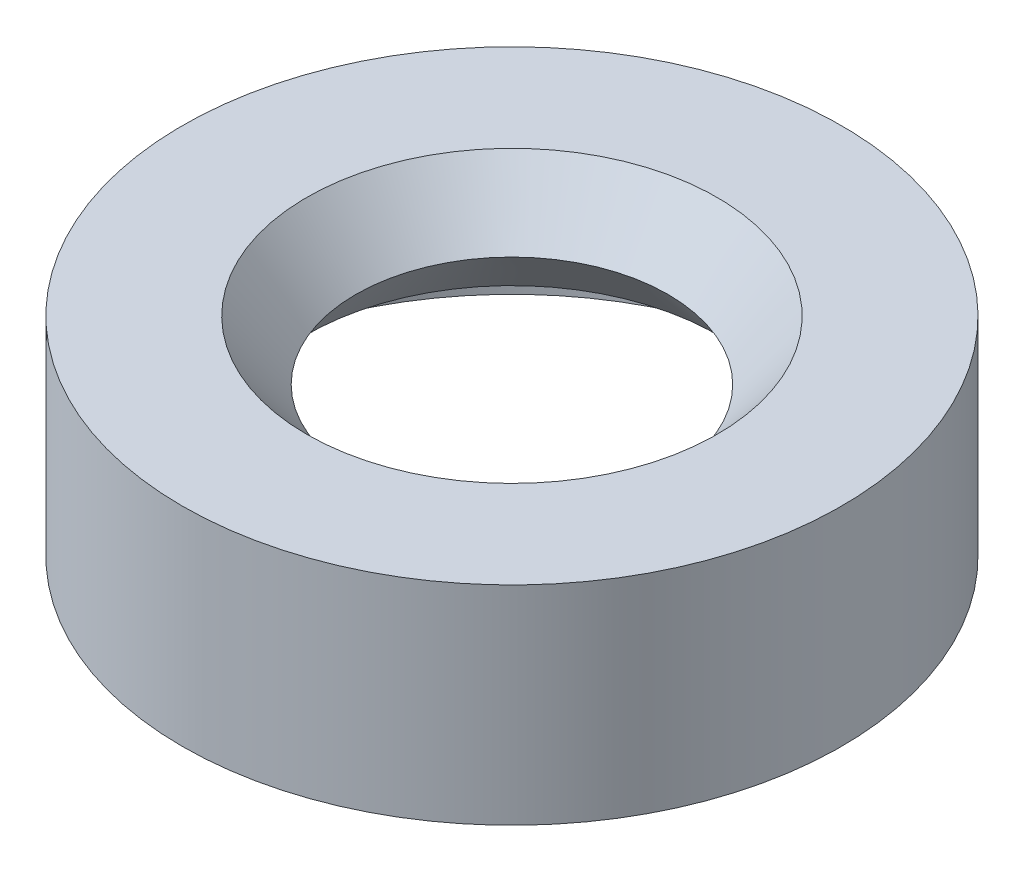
ISO-10303-21;
HEADER;
FILE_DESCRIPTION(('STEP AP214'),'2;1');
FILE_NAME('part.step','',(''),(''),'','','');
FILE_SCHEMA(('AUTOMOTIVE_DESIGN { 1 0 10303 214 1 1 1 1 }'));
ENDSEC;
DATA;
#1=APPLICATION_CONTEXT('core data for automotive mechanical design processes');
#2=APPLICATION_PROTOCOL_DEFINITION('international standard','automotive_design',2000,#1);
#3=PRODUCT_CONTEXT('',#1,'mechanical');
#4=PRODUCT('Part','Part','',(#3));
#5=PRODUCT_RELATED_PRODUCT_CATEGORY('part','',(#4));
#6=PRODUCT_DEFINITION_FORMATION('','',#4);
#7=PRODUCT_DEFINITION_CONTEXT('part definition',#1,'design');
#8=PRODUCT_DEFINITION('design','',#6,#7);
#9=PRODUCT_DEFINITION_SHAPE('','',#8);
#10=(LENGTH_UNIT() NAMED_UNIT(*) SI_UNIT(.MILLI.,.METRE.));
#11=(NAMED_UNIT(*) PLANE_ANGLE_UNIT() SI_UNIT($,.RADIAN.));
#12=(NAMED_UNIT(*) SI_UNIT($,.STERADIAN.) SOLID_ANGLE_UNIT());
#13=UNCERTAINTY_MEASURE_WITH_UNIT(LENGTH_MEASURE(1.E-05),#10,'distance_accuracy_value','');
#14=(GEOMETRIC_REPRESENTATION_CONTEXT(3) GLOBAL_UNCERTAINTY_ASSIGNED_CONTEXT((#13)) GLOBAL_UNIT_ASSIGNED_CONTEXT((#10,
#11,#12)) REPRESENTATION_CONTEXT('',''));
#15=CARTESIAN_POINT('',(0.,0.,0.));
#16=DIRECTION('',(0.,0.,1.));
#17=DIRECTION('',(1.,0.,0.));
#18=AXIS2_PLACEMENT_3D('',#15,#16,#17);
#19=CARTESIAN_POINT('',(0.,-1.71365372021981,0.));
#20=DIRECTION('',(0.,-1.,0.));
#21=DIRECTION('',(0.,0.,-1.));
#22=AXIS2_PLACEMENT_3D('',#19,#20,#21);
#23=CONICAL_SURFACE('',#22,4.82947187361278,0.690495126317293);
#24=CARTESIAN_POINT('',(0.,-3.26553002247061,0.));
#25=DIRECTION('',(0.,1.,0.));
#26=DIRECTION('',(0.,0.,1.));
#27=AXIS2_PLACEMENT_3D('',#24,#25,#26);
#28=CIRCLE('',#27,6.11158372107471);
#29=CARTESIAN_POINT('',(0.,-3.26553002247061,6.11158372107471));
#30=VERTEX_POINT('',#29);
#31=EDGE_CURVE('E64',#30,#30,#28,.T.);
#32=ORIENTED_EDGE('',*,*,#31,.T.);
#33=EDGE_LOOP('',(#32));
#34=FACE_BOUND('',#33,.T.);
#35=CARTESIAN_POINT('',(0.,-1.71365372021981,0.));
#36=DIRECTION('',(0.,1.,0.));
#37=DIRECTION('',(0.,0.,1.));
#38=AXIS2_PLACEMENT_3D('',#35,#36,#37);
#39=CIRCLE('',#38,4.82947187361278);
#40=CARTESIAN_POINT('',(0.,-1.71365372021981,4.82947187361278));
#41=VERTEX_POINT('',#40);
#42=EDGE_CURVE('E10',#41,#41,#39,.T.);
#43=ORIENTED_EDGE('',*,*,#42,.F.);
#44=EDGE_LOOP('',(#43));
#45=FACE_BOUND('',#44,.T.);
#46=ADVANCED_FACE('F30',(#34,#45),#23,.T.);
#47=CARTESIAN_POINT('',(0.,-0.254000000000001,0.));
#48=DIRECTION('',(0.,1.,0.));
#49=DIRECTION('',(0.,0.,1.));
#50=AXIS2_PLACEMENT_3D('',#47,#48,#49);
#51=CONICAL_SURFACE('',#50,6.03539229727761,0.690495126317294);
#52=ORIENTED_EDGE('',*,*,#42,.T.);
#53=EDGE_LOOP('',(#52));
#54=FACE_BOUND('',#53,.T.);
#55=CARTESIAN_POINT('',(0.,-0.254000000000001,0.));
#56=DIRECTION('',(0.,1.,0.));
#57=DIRECTION('',(0.,0.,1.));
#58=AXIS2_PLACEMENT_3D('',#55,#56,#57);
#59=CIRCLE('',#58,6.03539229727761);
#60=CARTESIAN_POINT('',(0.,-0.254000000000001,6.03539229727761));
#61=VERTEX_POINT('',#60);
#62=EDGE_CURVE('E36',#61,#61,#59,.T.);
#63=ORIENTED_EDGE('',*,*,#62,.F.);
#64=EDGE_LOOP('',(#63));
#65=FACE_BOUND('',#64,.T.);
#66=ADVANCED_FACE('F114',(#54,#65),#51,.T.);
#67=CARTESIAN_POINT('',(-9.5,-0.254,0.));
#68=DIRECTION('',(0.,-1.,0.));
#69=DIRECTION('',(0.,0.,-1.));
#70=AXIS2_PLACEMENT_3D('',#67,#68,#69);
#71=PLANE('',#70);
#72=ORIENTED_EDGE('',*,*,#62,.T.);
#73=EDGE_LOOP('',(#72));
#74=FACE_BOUND('',#73,.T.);
#75=CARTESIAN_POINT('',(0.,-0.254000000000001,0.));
#76=DIRECTION('',(0.,1.,0.));
#77=DIRECTION('',(0.,0.,1.));
#78=AXIS2_PLACEMENT_3D('',#75,#76,#77);
#79=CIRCLE('',#78,9.246);
#80=CARTESIAN_POINT('',(0.,-0.254000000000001,9.246));
#81=VERTEX_POINT('',#80);
#82=EDGE_CURVE('E40',#81,#81,#79,.T.);
#83=ORIENTED_EDGE('',*,*,#82,.F.);
#84=EDGE_LOOP('',(#83));
#85=FACE_BOUND('',#84,.T.);
#86=ADVANCED_FACE('F108',(#74,#85),#71,.T.);
#87=CARTESIAN_POINT('',(0.,8.2008547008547,0.));
#88=DIRECTION('',(0.,1.,0.));
#89=DIRECTION('',(0.,0.,1.));
#90=AXIS2_PLACEMENT_3D('',#87,#88,#89);
#91=CYLINDRICAL_SURFACE('',#90,9.246);
#92=ORIENTED_EDGE('',*,*,#82,.T.);
#93=EDGE_LOOP('',(#92));
#94=FACE_BOUND('',#93,.T.);
#95=CARTESIAN_POINT('',(0.,-6.,0.));
#96=DIRECTION('',(0.,1.,0.));
#97=DIRECTION('',(0.,0.,1.));
#98=AXIS2_PLACEMENT_3D('',#95,#96,#97);
#99=CIRCLE('',#98,9.246);
#100=CARTESIAN_POINT('',(0.,-6.,9.246));
#101=VERTEX_POINT('',#100);
#102=EDGE_CURVE('E44',#101,#101,#99,.T.);
#103=ORIENTED_EDGE('',*,*,#102,.F.);
#104=EDGE_LOOP('',(#103));
#105=FACE_BOUND('',#104,.T.);
#106=ADVANCED_FACE('F103',(#94,#105),#91,.F.);
#107=CARTESIAN_POINT('',(-9.246,-6.,0.));
#108=DIRECTION('',(0.,1.,0.));
#109=DIRECTION('',(0.,0.,1.));
#110=AXIS2_PLACEMENT_3D('',#107,#108,#109);
#111=PLANE('',#110);
#112=CARTESIAN_POINT('',(0.,-6.,0.));
#113=DIRECTION('',(0.,1.,0.));
#114=DIRECTION('',(0.,0.,1.));
#115=AXIS2_PLACEMENT_3D('',#112,#113,#114);
#116=CIRCLE('',#115,9.5);
#117=CARTESIAN_POINT('',(0.,-6.,9.5));
#118=VERTEX_POINT('',#117);
#119=EDGE_CURVE('E49',#118,#118,#116,.T.);
#120=ORIENTED_EDGE('',*,*,#119,.F.);
#121=EDGE_LOOP('',(#120));
#122=FACE_BOUND('',#121,.T.);
#123=ORIENTED_EDGE('',*,*,#102,.T.);
#124=EDGE_LOOP('',(#123));
#125=FACE_BOUND('',#124,.T.);
#126=ADVANCED_FACE('F97',(#122,#125),#111,.F.);
#127=CARTESIAN_POINT('',(0.,8.2008547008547,0.));
#128=DIRECTION('',(0.,1.,0.));
#129=DIRECTION('',(0.,0.,1.));
#130=AXIS2_PLACEMENT_3D('',#127,#128,#129);
#131=CYLINDRICAL_SURFACE('',#130,9.5);
#132=CARTESIAN_POINT('',(0.,0.,0.));
#133=DIRECTION('',(0.,1.,0.));
#134=DIRECTION('',(0.,0.,1.));
#135=AXIS2_PLACEMENT_3D('',#132,#133,#134);
#136=CIRCLE('',#135,9.5);
#137=CARTESIAN_POINT('',(0.,0.,9.5));
#138=VERTEX_POINT('',#137);
#139=EDGE_CURVE('E52',#138,#138,#136,.T.);
#140=ORIENTED_EDGE('',*,*,#139,.F.);
#141=EDGE_LOOP('',(#140));
#142=FACE_BOUND('',#141,.T.);
#143=ORIENTED_EDGE('',*,*,#119,.T.);
#144=EDGE_LOOP('',(#143));
#145=FACE_BOUND('',#144,.T.);
#146=ADVANCED_FACE('F91',(#142,#145),#131,.T.);
#147=CARTESIAN_POINT('',(-9.5,0.,0.));
#148=DIRECTION('',(0.,-1.,0.));
#149=DIRECTION('',(0.,0.,-1.));
#150=AXIS2_PLACEMENT_3D('',#147,#148,#149);
#151=PLANE('',#150);
#152=CARTESIAN_POINT('',(0.,0.,0.));
#153=DIRECTION('',(0.,1.,0.));
#154=DIRECTION('',(0.,0.,1.));
#155=AXIS2_PLACEMENT_3D('',#152,#153,#154);
#156=CIRCLE('',#155,5.91576730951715);
#157=CARTESIAN_POINT('',(0.,0.,5.91576730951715));
#158=VERTEX_POINT('',#157);
#159=EDGE_CURVE('E55',#158,#158,#156,.T.);
#160=ORIENTED_EDGE('',*,*,#159,.F.);
#161=EDGE_LOOP('',(#160));
#162=FACE_BOUND('',#161,.T.);
#163=ORIENTED_EDGE('',*,*,#139,.T.);
#164=EDGE_LOOP('',(#163));
#165=FACE_BOUND('',#164,.T.);
#166=ADVANCED_FACE('F85',(#162,#165),#151,.F.);
#167=CARTESIAN_POINT('',(0.,0.,0.));
#168=DIRECTION('',(0.,1.,0.));
#169=DIRECTION('',(0.,0.,1.));
#170=AXIS2_PLACEMENT_3D('',#167,#168,#169);
#171=CONICAL_SURFACE('',#170,5.91576730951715,0.690495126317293);
#172=CARTESIAN_POINT('',(0.,-1.71365372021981,0.));
#173=DIRECTION('',(0.,1.,0.));
#174=DIRECTION('',(0.,0.,1.));
#175=AXIS2_PLACEMENT_3D('',#172,#173,#174);
#176=CIRCLE('',#175,4.5);
#177=CARTESIAN_POINT('',(0.,-1.71365372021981,4.5));
#178=VERTEX_POINT('',#177);
#179=EDGE_CURVE('E58',#178,#178,#176,.T.);
#180=ORIENTED_EDGE('',*,*,#179,.F.);
#181=EDGE_LOOP('',(#180));
#182=FACE_BOUND('',#181,.T.);
#183=ORIENTED_EDGE('',*,*,#159,.T.);
#184=EDGE_LOOP('',(#183));
#185=FACE_BOUND('',#184,.T.);
#186=ADVANCED_FACE('F79',(#182,#185),#171,.F.);
#187=CARTESIAN_POINT('',(0.,-1.71365372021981,0.));
#188=DIRECTION('',(0.,-1.,0.));
#189=DIRECTION('',(0.,0.,-1.));
#190=AXIS2_PLACEMENT_3D('',#187,#188,#189);
#191=CONICAL_SURFACE('',#190,4.5,0.690495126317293);
#192=CARTESIAN_POINT('',(0.,-3.42730744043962,0.));
#193=DIRECTION('',(0.,1.,0.));
#194=DIRECTION('',(0.,0.,1.));
#195=AXIS2_PLACEMENT_3D('',#192,#193,#194);
#196=CIRCLE('',#195,5.91576730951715);
#197=CARTESIAN_POINT('',(0.,-3.42730744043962,5.91576730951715));
#198=VERTEX_POINT('',#197);
#199=EDGE_CURVE('E61',#198,#198,#196,.T.);
#200=ORIENTED_EDGE('',*,*,#199,.F.);
#201=EDGE_LOOP('',(#200));
#202=FACE_BOUND('',#201,.T.);
#203=ORIENTED_EDGE('',*,*,#179,.T.);
#204=EDGE_LOOP('',(#203));
#205=FACE_BOUND('',#204,.T.);
#206=ADVANCED_FACE('F73',(#202,#205),#191,.F.);
#207=CARTESIAN_POINT('',(0.,-3.42730744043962,0.));
#208=DIRECTION('',(0.,1.,0.));
#209=DIRECTION('',(0.,0.,1.));
#210=AXIS2_PLACEMENT_3D('',#207,#208,#209);
#211=CONICAL_SURFACE('',#210,5.91576730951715,0.880301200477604);
#212=ORIENTED_EDGE('',*,*,#31,.F.);
#213=EDGE_LOOP('',(#212));
#214=FACE_BOUND('',#213,.T.);
#215=ORIENTED_EDGE('',*,*,#199,.T.);
#216=EDGE_LOOP('',(#215));
#217=FACE_BOUND('',#216,.T.);
#218=ADVANCED_FACE('F70',(#214,#217),#211,.T.);
#219=CLOSED_SHELL('',(#46,#66,#86,#106,#126,#146,#166,#186,#206,#218));
#220=MANIFOLD_SOLID_BREP('B2',#219);
#221=ADVANCED_BREP_SHAPE_REPRESENTATION('',(#18,#220),#14);
#222=SHAPE_DEFINITION_REPRESENTATION(#9,#221);
ENDSEC;
END-ISO-10303-21;
